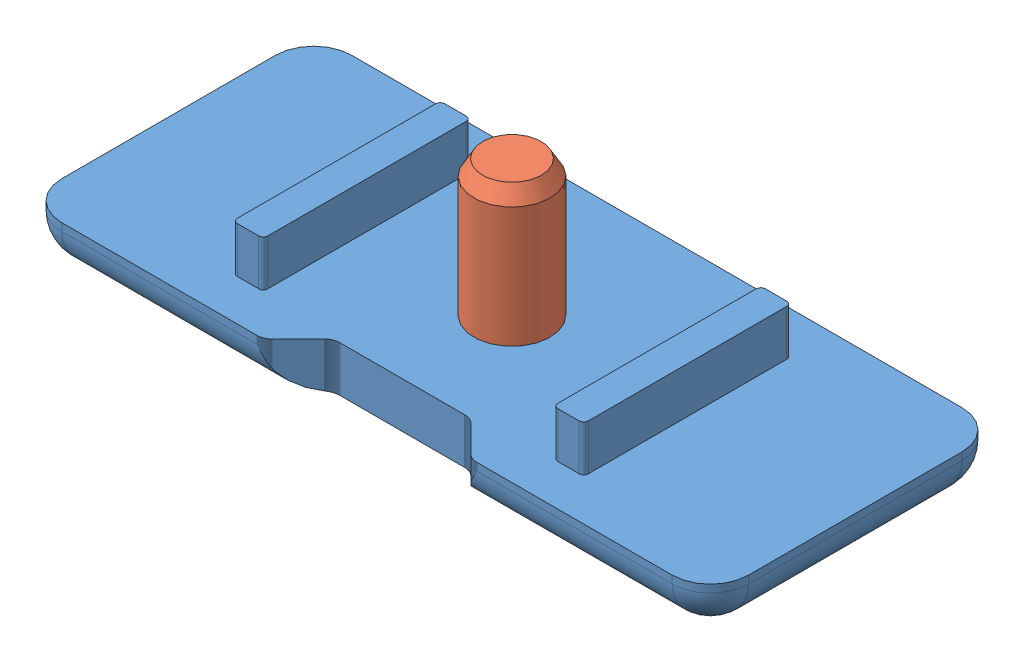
SolidWorks assembly 22.1001_1 END CAP 19X45 GRAY.SLDASM, configuration Default (file format 6000). Lengths in mm.
Overall size (45.53 12.94 19.53).
2 component instances, 2 part files, 2 mates.
Components (placement in the parent):
- 22.1001_1 END CAP 19X45 GRAY-1: 22.1001_1 END CAP 19X45 GRAY.SLDPRT [Default] at origin size (45.53 7.04 19.53)
- END CAP DOWEL GRAY-1: END CAP DOWEL GRAY.SLDPRT [Default] at (-216.8325 10 10.5242) x (0.946864 0 0.321634) z (0 1 0) size (5 5 11.9)
Mates (geometry in assembly coordinates):
- Concentric1: concentric: cylinder of 22.1001_1 END CAP 19X45 GRAY-1 through (22.5 -2.8 9.5) axis (0 1 0) radius 2.25; circle of END CAP DOWEL GRAY-1
- Coincident1: coincident aligned: plane of 22.1001_1 END CAP 19X45 GRAY-1 through (22.5 -3 9.5) normal (0 -1 0); plane of END CAP DOWEL GRAY-1 through (22.5 -3 9.5) normal (0 -1 0)
